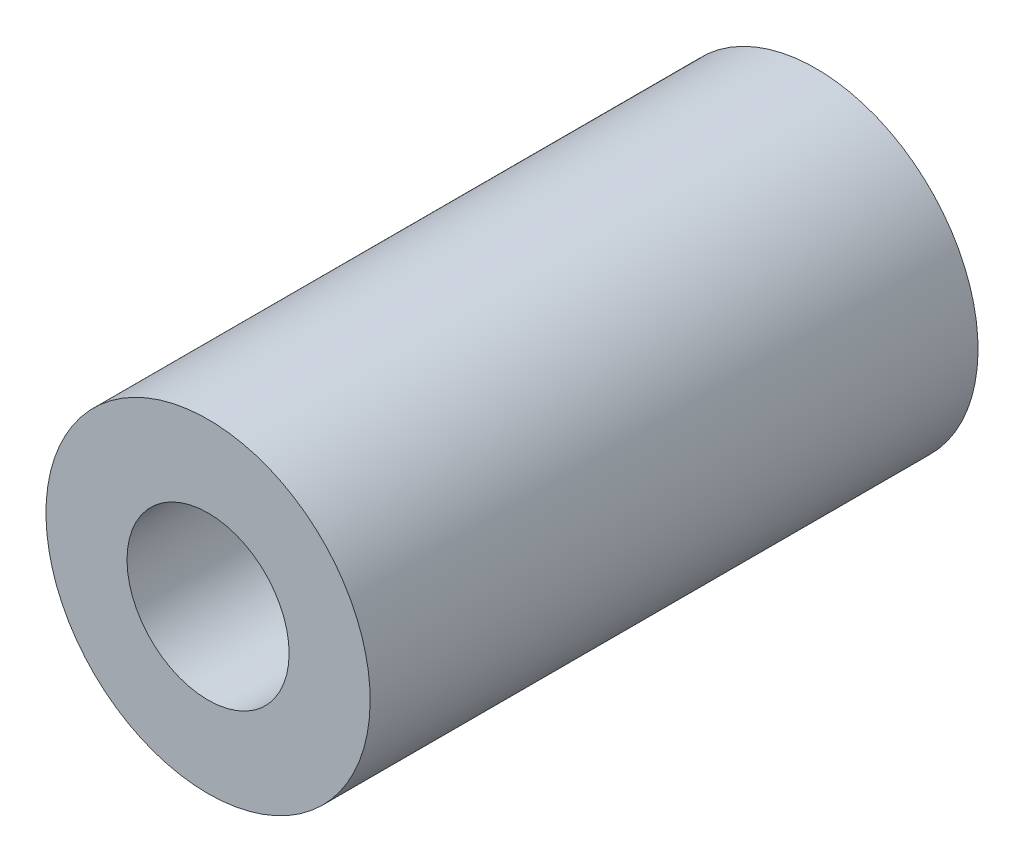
ISO-10303-21;
HEADER;
FILE_DESCRIPTION(('STEP AP214'),'2;1');
FILE_NAME('part.step','',(''),(''),'','','');
FILE_SCHEMA(('AUTOMOTIVE_DESIGN { 1 0 10303 214 1 1 1 1 }'));
ENDSEC;
DATA;
#1=APPLICATION_CONTEXT('core data for automotive mechanical design processes');
#2=APPLICATION_PROTOCOL_DEFINITION('international standard','automotive_design',2000,#1);
#3=PRODUCT_CONTEXT('',#1,'mechanical');
#4=PRODUCT('Part','Part','',(#3));
#5=PRODUCT_RELATED_PRODUCT_CATEGORY('part','',(#4));
#6=PRODUCT_DEFINITION_FORMATION('','',#4);
#7=PRODUCT_DEFINITION_CONTEXT('part definition',#1,'design');
#8=PRODUCT_DEFINITION('design','',#6,#7);
#9=PRODUCT_DEFINITION_SHAPE('','',#8);
#10=(LENGTH_UNIT() NAMED_UNIT(*) SI_UNIT(.MILLI.,.METRE.));
#11=(NAMED_UNIT(*) PLANE_ANGLE_UNIT() SI_UNIT($,.RADIAN.));
#12=(NAMED_UNIT(*) SI_UNIT($,.STERADIAN.) SOLID_ANGLE_UNIT());
#13=UNCERTAINTY_MEASURE_WITH_UNIT(LENGTH_MEASURE(1.E-05),#10,'distance_accuracy_value','');
#14=(GEOMETRIC_REPRESENTATION_CONTEXT(3) GLOBAL_UNCERTAINTY_ASSIGNED_CONTEXT((#13)) GLOBAL_UNIT_ASSIGNED_CONTEXT((#10,
#11,#12)) REPRESENTATION_CONTEXT('',''));
#15=CARTESIAN_POINT('',(0.,0.,0.));
#16=DIRECTION('',(0.,0.,1.));
#17=DIRECTION('',(1.,0.,0.));
#18=AXIS2_PLACEMENT_3D('',#15,#16,#17);
#19=CARTESIAN_POINT('',(0.,0.,30.));
#20=DIRECTION('',(0.,0.,-1.));
#21=DIRECTION('',(0.,1.,0.));
#22=AXIS2_PLACEMENT_3D('',#19,#20,#21);
#23=CYLINDRICAL_SURFACE('',#22,8.);
#24=CARTESIAN_POINT('',(0.,0.,30.));
#25=DIRECTION('',(0.,0.,1.));
#26=DIRECTION('',(0.,-1.,0.));
#27=AXIS2_PLACEMENT_3D('',#24,#25,#26);
#28=CIRCLE('',#27,8.);
#29=CARTESIAN_POINT('',(0.,-8.,30.));
#30=VERTEX_POINT('',#29);
#31=EDGE_CURVE('E8',#30,#30,#28,.T.);
#32=ORIENTED_EDGE('',*,*,#31,.F.);
#33=EDGE_LOOP('',(#32));
#34=FACE_BOUND('',#33,.T.);
#35=CARTESIAN_POINT('',(0.,0.,0.));
#36=DIRECTION('',(0.,0.,1.));
#37=DIRECTION('',(0.,-1.,0.));
#38=AXIS2_PLACEMENT_3D('',#35,#36,#37);
#39=CIRCLE('',#38,8.);
#40=CARTESIAN_POINT('',(0.,-8.,0.));
#41=VERTEX_POINT('',#40);
#42=EDGE_CURVE('E18',#41,#41,#39,.T.);
#43=ORIENTED_EDGE('',*,*,#42,.T.);
#44=EDGE_LOOP('',(#43));
#45=FACE_BOUND('',#44,.T.);
#46=ADVANCED_FACE('F12',(#34,#45),#23,.T.);
#47=CARTESIAN_POINT('',(0.,0.,30.));
#48=DIRECTION('',(0.,0.,1.));
#49=DIRECTION('',(0.,-1.,0.));
#50=AXIS2_PLACEMENT_3D('',#47,#48,#49);
#51=PLANE('',#50);
#52=CARTESIAN_POINT('',(0.,0.,30.));
#53=DIRECTION('',(0.,0.,1.));
#54=DIRECTION('',(0.,-1.,0.));
#55=AXIS2_PLACEMENT_3D('',#52,#53,#54);
#56=CIRCLE('',#55,4.);
#57=CARTESIAN_POINT('',(0.,-4.,30.));
#58=VERTEX_POINT('',#57);
#59=EDGE_CURVE('E26',#58,#58,#56,.T.);
#60=ORIENTED_EDGE('',*,*,#59,.F.);
#61=EDGE_LOOP('',(#60));
#62=FACE_BOUND('',#61,.T.);
#63=ORIENTED_EDGE('',*,*,#31,.T.);
#64=EDGE_LOOP('',(#63));
#65=FACE_BOUND('',#64,.T.);
#66=ADVANCED_FACE('F34',(#62,#65),#51,.T.);
#67=CARTESIAN_POINT('',(0.,0.,0.));
#68=DIRECTION('',(0.,0.,1.));
#69=DIRECTION('',(0.,-1.,0.));
#70=AXIS2_PLACEMENT_3D('',#67,#68,#69);
#71=PLANE('',#70);
#72=ORIENTED_EDGE('',*,*,#42,.F.);
#73=EDGE_LOOP('',(#72));
#74=FACE_BOUND('',#73,.T.);
#75=ADVANCED_FACE('F36',(#74),#71,.F.);
#76=CARTESIAN_POINT('',(0.,0.,15.));
#77=DIRECTION('',(0.,0.,1.));
#78=DIRECTION('',(0.,-1.,0.));
#79=AXIS2_PLACEMENT_3D('',#76,#77,#78);
#80=PLANE('',#79);
#81=CARTESIAN_POINT('',(0.,0.,15.));
#82=DIRECTION('',(0.,0.,1.));
#83=DIRECTION('',(0.,-1.,0.));
#84=AXIS2_PLACEMENT_3D('',#81,#82,#83);
#85=CIRCLE('',#84,4.);
#86=CARTESIAN_POINT('',(0.,-4.,15.));
#87=VERTEX_POINT('',#86);
#88=EDGE_CURVE('E22',#87,#87,#85,.T.);
#89=ORIENTED_EDGE('',*,*,#88,.T.);
#90=EDGE_LOOP('',(#89));
#91=FACE_BOUND('',#90,.T.);
#92=ADVANCED_FACE('F43',(#91),#80,.T.);
#93=CARTESIAN_POINT('',(0.,0.,15.));
#94=DIRECTION('',(0.,0.,1.));
#95=DIRECTION('',(0.,-1.,0.));
#96=AXIS2_PLACEMENT_3D('',#93,#94,#95);
#97=CYLINDRICAL_SURFACE('',#96,4.);
#98=ORIENTED_EDGE('',*,*,#88,.F.);
#99=EDGE_LOOP('',(#98));
#100=FACE_BOUND('',#99,.T.);
#101=ORIENTED_EDGE('',*,*,#59,.T.);
#102=EDGE_LOOP('',(#101));
#103=FACE_BOUND('',#102,.T.);
#104=ADVANCED_FACE('F32',(#100,#103),#97,.F.);
#105=CLOSED_SHELL('',(#46,#66,#75,#92,#104));
#106=MANIFOLD_SOLID_BREP('B1',#105);
#107=ADVANCED_BREP_SHAPE_REPRESENTATION('',(#18,#106),#14);
#108=SHAPE_DEFINITION_REPRESENTATION(#9,#107);
ENDSEC;
END-ISO-10303-21;
